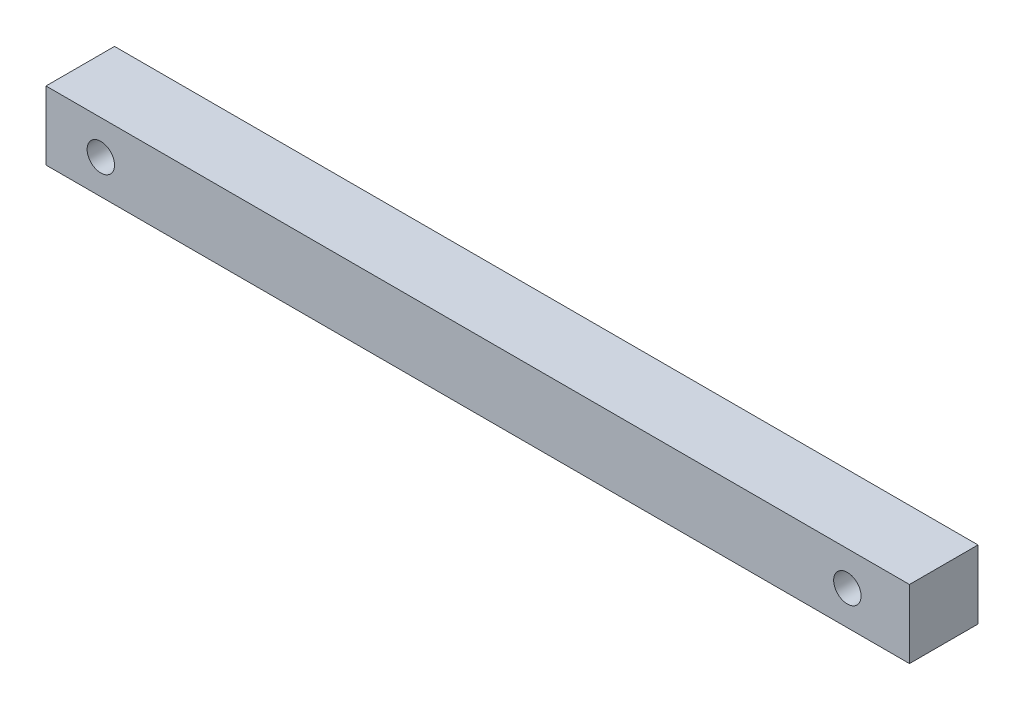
ISO-10303-21;
HEADER;
FILE_DESCRIPTION(('STEP AP214'),'2;1');
FILE_NAME('part.step','',(''),(''),'','','');
FILE_SCHEMA(('AUTOMOTIVE_DESIGN { 1 0 10303 214 1 1 1 1 }'));
ENDSEC;
DATA;
#1=APPLICATION_CONTEXT('core data for automotive mechanical design processes');
#2=APPLICATION_PROTOCOL_DEFINITION('international standard','automotive_design',2000,#1);
#3=PRODUCT_CONTEXT('',#1,'mechanical');
#4=PRODUCT('Part','Part','',(#3));
#5=PRODUCT_RELATED_PRODUCT_CATEGORY('part','',(#4));
#6=PRODUCT_DEFINITION_FORMATION('','',#4);
#7=PRODUCT_DEFINITION_CONTEXT('part definition',#1,'design');
#8=PRODUCT_DEFINITION('design','',#6,#7);
#9=PRODUCT_DEFINITION_SHAPE('','',#8);
#10=(LENGTH_UNIT() NAMED_UNIT(*) SI_UNIT(.MILLI.,.METRE.));
#11=(NAMED_UNIT(*) PLANE_ANGLE_UNIT() SI_UNIT($,.RADIAN.));
#12=(NAMED_UNIT(*) SI_UNIT($,.STERADIAN.) SOLID_ANGLE_UNIT());
#13=UNCERTAINTY_MEASURE_WITH_UNIT(LENGTH_MEASURE(1.E-05),#10,'distance_accuracy_value','');
#14=(GEOMETRIC_REPRESENTATION_CONTEXT(3) GLOBAL_UNCERTAINTY_ASSIGNED_CONTEXT((#13)) GLOBAL_UNIT_ASSIGNED_CONTEXT((#10,
#11,#12)) REPRESENTATION_CONTEXT('',''));
#15=CARTESIAN_POINT('',(0.,0.,0.));
#16=DIRECTION('',(0.,0.,1.));
#17=DIRECTION('',(1.,0.,0.));
#18=AXIS2_PLACEMENT_3D('',#15,#16,#17);
#19=CARTESIAN_POINT('',(-33.,2.5,5.));
#20=DIRECTION('',(1.,0.,0.));
#21=DIRECTION('',(0.,0.,-1.));
#22=AXIS2_PLACEMENT_3D('',#19,#20,#21);
#23=PLANE('',#22);
#24=DIRECTION('',(0.,-1.,0.));
#25=VECTOR('',#24,1.);
#26=CARTESIAN_POINT('',(-33.,2.5,0.));
#27=LINE('',#26,#25);
#28=CARTESIAN_POINT('',(-33.,2.5,0.));
#29=VERTEX_POINT('',#28);
#30=CARTESIAN_POINT('',(-33.,-2.5,0.));
#31=VERTEX_POINT('',#30);
#32=EDGE_CURVE('E96',#29,#31,#27,.T.);
#33=ORIENTED_EDGE('',*,*,#32,.T.);
#34=DIRECTION('',(0.,0.,-1.));
#35=VECTOR('',#34,1.);
#36=CARTESIAN_POINT('',(-33.,-2.5,5.));
#37=LINE('',#36,#35);
#38=CARTESIAN_POINT('',(-33.,-2.5,5.));
#39=VERTEX_POINT('',#38);
#40=EDGE_CURVE('E11',#39,#31,#37,.T.);
#41=ORIENTED_EDGE('',*,*,#40,.F.);
#42=DIRECTION('',(0.,-1.,0.));
#43=VECTOR('',#42,1.);
#44=CARTESIAN_POINT('',(-33.,2.5,5.));
#45=LINE('',#44,#43);
#46=CARTESIAN_POINT('',(-33.,2.5,5.));
#47=VERTEX_POINT('',#46);
#48=EDGE_CURVE('E84',#47,#39,#45,.T.);
#49=ORIENTED_EDGE('',*,*,#48,.F.);
#50=DIRECTION('',(0.,0.,-1.));
#51=VECTOR('',#50,1.);
#52=CARTESIAN_POINT('',(-33.,2.5,5.));
#53=LINE('',#52,#51);
#54=EDGE_CURVE('E92',#47,#29,#53,.T.);
#55=ORIENTED_EDGE('',*,*,#54,.T.);
#56=EDGE_LOOP('',(#33,#41,#49,#55));
#57=FACE_BOUND('',#56,.T.);
#58=ADVANCED_FACE('F33',(#57),#23,.F.);
#59=CARTESIAN_POINT('',(-33.,-2.5,5.));
#60=DIRECTION('',(0.,1.,0.));
#61=DIRECTION('',(0.,0.,1.));
#62=AXIS2_PLACEMENT_3D('',#59,#60,#61);
#63=PLANE('',#62);
#64=DIRECTION('',(1.,0.,0.));
#65=VECTOR('',#64,1.);
#66=CARTESIAN_POINT('',(-33.,-2.5,0.));
#67=LINE('',#66,#65);
#68=CARTESIAN_POINT('',(30.,-2.5,0.));
#69=VERTEX_POINT('',#68);
#70=EDGE_CURVE('E88',#31,#69,#67,.T.);
#71=ORIENTED_EDGE('',*,*,#70,.T.);
#72=DIRECTION('',(0.,0.,-1.));
#73=VECTOR('',#72,1.);
#74=CARTESIAN_POINT('',(30.,-2.5,5.));
#75=LINE('',#74,#73);
#76=CARTESIAN_POINT('',(30.,-2.5,5.));
#77=VERTEX_POINT('',#76);
#78=EDGE_CURVE('E41',#77,#69,#75,.T.);
#79=ORIENTED_EDGE('',*,*,#78,.F.);
#80=DIRECTION('',(1.,0.,0.));
#81=VECTOR('',#80,1.);
#82=CARTESIAN_POINT('',(-33.,-2.5,5.));
#83=LINE('',#82,#81);
#84=EDGE_CURVE('E79',#39,#77,#83,.T.);
#85=ORIENTED_EDGE('',*,*,#84,.F.);
#86=ORIENTED_EDGE('',*,*,#40,.T.);
#87=EDGE_LOOP('',(#71,#79,#85,#86));
#88=FACE_BOUND('',#87,.T.);
#89=ADVANCED_FACE('F87',(#88),#63,.F.);
#90=CARTESIAN_POINT('',(30.,2.5,5.));
#91=DIRECTION('',(-1.,0.,0.));
#92=DIRECTION('',(0.,0.,1.));
#93=AXIS2_PLACEMENT_3D('',#90,#91,#92);
#94=PLANE('',#93);
#95=DIRECTION('',(0.,1.,0.));
#96=VECTOR('',#95,1.);
#97=CARTESIAN_POINT('',(30.,2.5,0.));
#98=LINE('',#97,#96);
#99=CARTESIAN_POINT('',(30.,2.5,0.));
#100=VERTEX_POINT('',#99);
#101=EDGE_CURVE('E66',#69,#100,#98,.T.);
#102=ORIENTED_EDGE('',*,*,#101,.T.);
#103=DIRECTION('',(0.,0.,-1.));
#104=VECTOR('',#103,1.);
#105=CARTESIAN_POINT('',(30.,2.5,5.));
#106=LINE('',#105,#104);
#107=CARTESIAN_POINT('',(30.,2.5,5.));
#108=VERTEX_POINT('',#107);
#109=EDGE_CURVE('E89',#108,#100,#106,.T.);
#110=ORIENTED_EDGE('',*,*,#109,.F.);
#111=DIRECTION('',(0.,1.,0.));
#112=VECTOR('',#111,1.);
#113=CARTESIAN_POINT('',(30.,2.5,5.));
#114=LINE('',#113,#112);
#115=EDGE_CURVE('E82',#77,#108,#114,.T.);
#116=ORIENTED_EDGE('',*,*,#115,.F.);
#117=ORIENTED_EDGE('',*,*,#78,.T.);
#118=EDGE_LOOP('',(#102,#110,#116,#117));
#119=FACE_BOUND('',#118,.T.);
#120=ADVANCED_FACE('F90',(#119),#94,.F.);
#121=CARTESIAN_POINT('',(-33.,2.5,5.));
#122=DIRECTION('',(0.,-1.,0.));
#123=DIRECTION('',(0.,0.,-1.));
#124=AXIS2_PLACEMENT_3D('',#121,#122,#123);
#125=PLANE('',#124);
#126=DIRECTION('',(-1.,0.,0.));
#127=VECTOR('',#126,1.);
#128=CARTESIAN_POINT('',(-33.,2.5,0.));
#129=LINE('',#128,#127);
#130=EDGE_CURVE('E72',#100,#29,#129,.T.);
#131=ORIENTED_EDGE('',*,*,#130,.T.);
#132=ORIENTED_EDGE('',*,*,#54,.F.);
#133=DIRECTION('',(-1.,0.,0.));
#134=VECTOR('',#133,1.);
#135=CARTESIAN_POINT('',(-33.,2.5,5.));
#136=LINE('',#135,#134);
#137=EDGE_CURVE('E49',#108,#47,#136,.T.);
#138=ORIENTED_EDGE('',*,*,#137,.F.);
#139=ORIENTED_EDGE('',*,*,#109,.T.);
#140=EDGE_LOOP('',(#131,#132,#138,#139));
#141=FACE_BOUND('',#140,.T.);
#142=ADVANCED_FACE('F104',(#141),#125,.F.);
#143=CARTESIAN_POINT('',(0.,0.,5.));
#144=DIRECTION('',(0.,0.,1.));
#145=DIRECTION('',(1.,0.,0.));
#146=AXIS2_PLACEMENT_3D('',#143,#144,#145);
#147=PLANE('',#146);
#148=CARTESIAN_POINT('',(25.4676814,0.,5.));
#149=DIRECTION('',(0.,0.,1.));
#150=DIRECTION('',(1.,0.,0.));
#151=AXIS2_PLACEMENT_3D('',#148,#149,#150);
#152=CIRCLE('',#151,0.999999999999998);
#153=CARTESIAN_POINT('',(26.4676814,0.,5.));
#154=VERTEX_POINT('',#153);
#155=EDGE_CURVE('E116',#154,#154,#152,.T.);
#156=ORIENTED_EDGE('',*,*,#155,.F.);
#157=EDGE_LOOP('',(#156));
#158=FACE_BOUND('',#157,.T.);
#159=CARTESIAN_POINT('',(-29.,0.,5.));
#160=DIRECTION('',(0.,0.,1.));
#161=DIRECTION('',(1.,0.,0.));
#162=AXIS2_PLACEMENT_3D('',#159,#160,#161);
#163=CIRCLE('',#162,1.);
#164=CARTESIAN_POINT('',(-28.,0.,5.));
#165=VERTEX_POINT('',#164);
#166=EDGE_CURVE('E110',#165,#165,#163,.T.);
#167=ORIENTED_EDGE('',*,*,#166,.F.);
#168=EDGE_LOOP('',(#167));
#169=FACE_BOUND('',#168,.T.);
#170=ORIENTED_EDGE('',*,*,#48,.T.);
#171=ORIENTED_EDGE('',*,*,#84,.T.);
#172=ORIENTED_EDGE('',*,*,#115,.T.);
#173=ORIENTED_EDGE('',*,*,#137,.T.);
#174=EDGE_LOOP('',(#170,#171,#172,#173));
#175=FACE_BOUND('',#174,.T.);
#176=ADVANCED_FACE('F80',(#158,#169,#175),#147,.T.);
#177=CARTESIAN_POINT('',(0.,0.,0.));
#178=DIRECTION('',(0.,0.,1.));
#179=DIRECTION('',(1.,0.,0.));
#180=AXIS2_PLACEMENT_3D('',#177,#178,#179);
#181=PLANE('',#180);
#182=CARTESIAN_POINT('',(25.4676814,0.,0.));
#183=DIRECTION('',(0.,0.,1.));
#184=DIRECTION('',(1.,0.,0.));
#185=AXIS2_PLACEMENT_3D('',#182,#183,#184);
#186=CIRCLE('',#185,0.999999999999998);
#187=CARTESIAN_POINT('',(26.4676814,0.,0.));
#188=VERTEX_POINT('',#187);
#189=EDGE_CURVE('E113',#188,#188,#186,.T.);
#190=ORIENTED_EDGE('',*,*,#189,.T.);
#191=EDGE_LOOP('',(#190));
#192=FACE_BOUND('',#191,.T.);
#193=CARTESIAN_POINT('',(-29.,0.,0.));
#194=DIRECTION('',(0.,0.,1.));
#195=DIRECTION('',(1.,0.,0.));
#196=AXIS2_PLACEMENT_3D('',#193,#194,#195);
#197=CIRCLE('',#196,1.);
#198=CARTESIAN_POINT('',(-28.,0.,0.));
#199=VERTEX_POINT('',#198);
#200=EDGE_CURVE('E99',#199,#199,#197,.T.);
#201=ORIENTED_EDGE('',*,*,#200,.T.);
#202=EDGE_LOOP('',(#201));
#203=FACE_BOUND('',#202,.T.);
#204=ORIENTED_EDGE('',*,*,#32,.F.);
#205=ORIENTED_EDGE('',*,*,#130,.F.);
#206=ORIENTED_EDGE('',*,*,#101,.F.);
#207=ORIENTED_EDGE('',*,*,#70,.F.);
#208=EDGE_LOOP('',(#204,#205,#206,#207));
#209=FACE_BOUND('',#208,.T.);
#210=ADVANCED_FACE('F107',(#192,#203,#209),#181,.F.);
#211=CARTESIAN_POINT('',(-29.,0.,0.));
#212=DIRECTION('',(0.,0.,1.));
#213=DIRECTION('',(1.,0.,0.));
#214=AXIS2_PLACEMENT_3D('',#211,#212,#213);
#215=CYLINDRICAL_SURFACE('',#214,1.);
#216=ORIENTED_EDGE('',*,*,#200,.F.);
#217=EDGE_LOOP('',(#216));
#218=FACE_BOUND('',#217,.T.);
#219=ORIENTED_EDGE('',*,*,#166,.T.);
#220=EDGE_LOOP('',(#219));
#221=FACE_BOUND('',#220,.T.);
#222=ADVANCED_FACE('F127',(#218,#221),#215,.F.);
#223=CARTESIAN_POINT('',(25.4676814,0.,0.));
#224=DIRECTION('',(0.,0.,1.));
#225=DIRECTION('',(1.,0.,0.));
#226=AXIS2_PLACEMENT_3D('',#223,#224,#225);
#227=CYLINDRICAL_SURFACE('',#226,0.999999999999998);
#228=ORIENTED_EDGE('',*,*,#189,.F.);
#229=EDGE_LOOP('',(#228));
#230=FACE_BOUND('',#229,.T.);
#231=ORIENTED_EDGE('',*,*,#155,.T.);
#232=EDGE_LOOP('',(#231));
#233=FACE_BOUND('',#232,.T.);
#234=ADVANCED_FACE('F124',(#230,#233),#227,.F.);
#235=CLOSED_SHELL('',(#58,#89,#120,#142,#176,#210,#222,#234));
#236=MANIFOLD_SOLID_BREP('B2',#235);
#237=ADVANCED_BREP_SHAPE_REPRESENTATION('',(#18,#236),#14);
#238=SHAPE_DEFINITION_REPRESENTATION(#9,#237);
ENDSEC;
END-ISO-10303-21;
